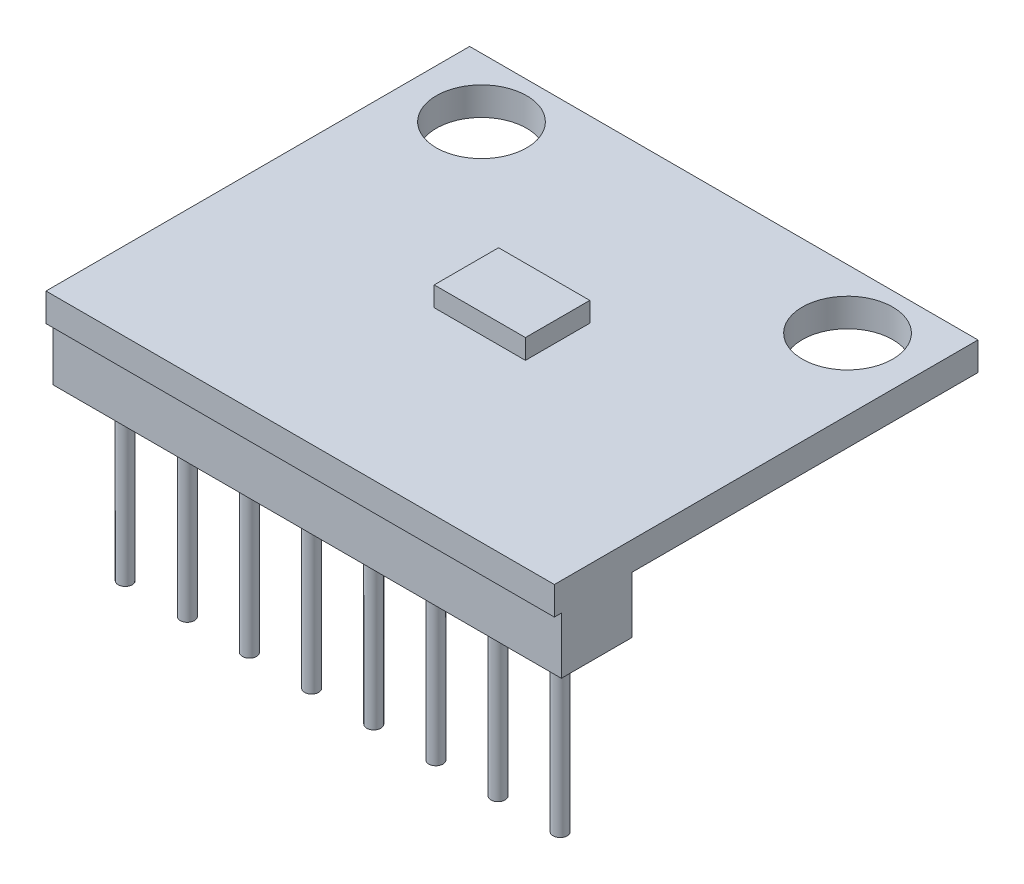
ISO-10303-21;
HEADER;
FILE_DESCRIPTION(('STEP AP214'),'2;1');
FILE_NAME('part.step','',(''),(''),'','','');
FILE_SCHEMA(('AUTOMOTIVE_DESIGN { 1 0 10303 214 1 1 1 1 }'));
ENDSEC;
DATA;
#1=APPLICATION_CONTEXT('core data for automotive mechanical design processes');
#2=APPLICATION_PROTOCOL_DEFINITION('international standard','automotive_design',2000,#1);
#3=PRODUCT_CONTEXT('',#1,'mechanical');
#4=PRODUCT('Part','Part','',(#3));
#5=PRODUCT_RELATED_PRODUCT_CATEGORY('part','',(#4));
#6=PRODUCT_DEFINITION_FORMATION('','',#4);
#7=PRODUCT_DEFINITION_CONTEXT('part definition',#1,'design');
#8=PRODUCT_DEFINITION('design','',#6,#7);
#9=PRODUCT_DEFINITION_SHAPE('','',#8);
#10=(LENGTH_UNIT() NAMED_UNIT(*) SI_UNIT(.MILLI.,.METRE.));
#11=(NAMED_UNIT(*) PLANE_ANGLE_UNIT() SI_UNIT($,.RADIAN.));
#12=(NAMED_UNIT(*) SI_UNIT($,.STERADIAN.) SOLID_ANGLE_UNIT());
#13=UNCERTAINTY_MEASURE_WITH_UNIT(LENGTH_MEASURE(1.E-05),#10,'distance_accuracy_value','');
#14=(GEOMETRIC_REPRESENTATION_CONTEXT(3) GLOBAL_UNCERTAINTY_ASSIGNED_CONTEXT((#13)) GLOBAL_UNIT_ASSIGNED_CONTEXT((#10,
#11,#12)) REPRESENTATION_CONTEXT('',''));
#15=CARTESIAN_POINT('',(0.,0.,0.));
#16=DIRECTION('',(0.,0.,1.));
#17=DIRECTION('',(1.,0.,0.));
#18=AXIS2_PLACEMENT_3D('',#15,#16,#17);
#19=CARTESIAN_POINT('',(0.,-1.,0.));
#20=DIRECTION('',(0.,1.,0.));
#21=DIRECTION('',(0.,0.,1.));
#22=AXIS2_PLACEMENT_3D('',#19,#20,#21);
#23=PLANE('',#22);
#24=CARTESIAN_POINT('',(-6.48,-1.,-5.4));
#25=DIRECTION('',(0.,1.,0.));
#26=DIRECTION('',(0.,0.,1.));
#27=AXIS2_PLACEMENT_3D('',#24,#25,#26);
#28=CIRCLE('',#27,1.6);
#29=CARTESIAN_POINT('',(-6.48,-1.,-3.8));
#30=VERTEX_POINT('',#29);
#31=EDGE_CURVE('E192',#30,#30,#28,.T.);
#32=ORIENTED_EDGE('',*,*,#31,.T.);
#33=EDGE_LOOP('',(#32));
#34=FACE_BOUND('',#33,.T.);
#35=CARTESIAN_POINT('',(6.48,-1.,-5.4));
#36=DIRECTION('',(0.,1.,0.));
#37=DIRECTION('',(0.,0.,-1.));
#38=AXIS2_PLACEMENT_3D('',#35,#36,#37);
#39=CIRCLE('',#38,1.6);
#40=CARTESIAN_POINT('',(6.48,-1.,-7.));
#41=VERTEX_POINT('',#40);
#42=EDGE_CURVE('E186',#41,#41,#39,.T.);
#43=ORIENTED_EDGE('',*,*,#42,.T.);
#44=EDGE_LOOP('',(#43));
#45=FACE_BOUND('',#44,.T.);
#46=DIRECTION('',(1.,0.,0.));
#47=VECTOR('',#46,1.);
#48=CARTESIAN_POINT('',(-9.,-1.,4.75264129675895));
#49=LINE('',#48,#47);
#50=CARTESIAN_POINT('',(-9.,-1.,4.75264129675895));
#51=VERTEX_POINT('',#50);
#52=CARTESIAN_POINT('',(9.00000000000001,-1.,4.75264129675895));
#53=VERTEX_POINT('',#52);
#54=EDGE_CURVE('E54',#51,#53,#49,.T.);
#55=ORIENTED_EDGE('',*,*,#54,.F.);
#56=DIRECTION('',(0.,0.,1.));
#57=VECTOR('',#56,1.);
#58=CARTESIAN_POINT('',(-9.,-1.,-7.5));
#59=LINE('',#58,#57);
#60=CARTESIAN_POINT('',(-9.,-1.,-7.5));
#61=VERTEX_POINT('',#60);
#62=EDGE_CURVE('E203',#61,#51,#59,.T.);
#63=ORIENTED_EDGE('',*,*,#62,.F.);
#64=DIRECTION('',(-1.,0.,0.));
#65=VECTOR('',#64,1.);
#66=CARTESIAN_POINT('',(-9.,-1.,-7.5));
#67=LINE('',#66,#65);
#68=CARTESIAN_POINT('',(9.00000000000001,-1.,-7.5));
#69=VERTEX_POINT('',#68);
#70=EDGE_CURVE('E199',#69,#61,#67,.T.);
#71=ORIENTED_EDGE('',*,*,#70,.F.);
#72=DIRECTION('',(0.,0.,-1.));
#73=VECTOR('',#72,1.);
#74=CARTESIAN_POINT('',(9.00000000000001,-1.,-7.5));
#75=LINE('',#74,#73);
#76=EDGE_CURVE('E59',#53,#69,#75,.T.);
#77=ORIENTED_EDGE('',*,*,#76,.F.);
#78=EDGE_LOOP('',(#55,#63,#71,#77));
#79=FACE_BOUND('',#78,.T.);
#80=ADVANCED_FACE('F37',(#34,#45,#79),#23,.F.);
#81=DIRECTION('',(-1.,0.,0.));
#82=VECTOR('',#81,1.);
#83=CARTESIAN_POINT('',(-9.,-1.,7.25264129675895));
#84=LINE('',#83,#82);
#85=CARTESIAN_POINT('',(9.00000000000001,-1.,7.25264129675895));
#86=VERTEX_POINT('',#85);
#87=CARTESIAN_POINT('',(-9.,-1.,7.25264129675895));
#88=VERTEX_POINT('',#87);
#89=EDGE_CURVE('E235',#86,#88,#84,.T.);
#90=ORIENTED_EDGE('',*,*,#89,.F.);
#91=CARTESIAN_POINT('',(9.00000000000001,-1.,7.5));
#92=VERTEX_POINT('',#91);
#93=EDGE_CURVE('E150',#92,#86,#75,.T.);
#94=ORIENTED_EDGE('',*,*,#93,.F.);
#95=DIRECTION('',(1.,0.,0.));
#96=VECTOR('',#95,1.);
#97=CARTESIAN_POINT('',(-9.,-1.,7.5));
#98=LINE('',#97,#96);
#99=CARTESIAN_POINT('',(-9.,-1.,7.5));
#100=VERTEX_POINT('',#99);
#101=EDGE_CURVE('E205',#100,#92,#98,.T.);
#102=ORIENTED_EDGE('',*,*,#101,.F.);
#103=EDGE_CURVE('E202',#88,#100,#59,.T.);
#104=ORIENTED_EDGE('',*,*,#103,.F.);
#105=EDGE_LOOP('',(#90,#94,#102,#104));
#106=FACE_BOUND('',#105,.T.);
#107=ADVANCED_FACE('F234',(#106),#23,.F.);
#108=CARTESIAN_POINT('',(0.,0.,0.));
#109=DIRECTION('',(0.,1.,0.));
#110=DIRECTION('',(0.,0.,1.));
#111=AXIS2_PLACEMENT_3D('',#108,#109,#110);
#112=PLANE('',#111);
#113=CARTESIAN_POINT('',(6.48,0.,-5.4));
#114=DIRECTION('',(0.,1.,0.));
#115=DIRECTION('',(0.,0.,-1.));
#116=AXIS2_PLACEMENT_3D('',#113,#114,#115);
#117=CIRCLE('',#116,1.6);
#118=CARTESIAN_POINT('',(6.48,0.,-7.));
#119=VERTEX_POINT('',#118);
#120=EDGE_CURVE('E185',#119,#119,#117,.T.);
#121=ORIENTED_EDGE('',*,*,#120,.F.);
#122=EDGE_LOOP('',(#121));
#123=FACE_BOUND('',#122,.T.);
#124=CARTESIAN_POINT('',(-6.48,0.,-5.4));
#125=DIRECTION('',(0.,1.,0.));
#126=DIRECTION('',(0.,0.,1.));
#127=AXIS2_PLACEMENT_3D('',#124,#125,#126);
#128=CIRCLE('',#127,1.6);
#129=CARTESIAN_POINT('',(-6.48,0.,-3.8));
#130=VERTEX_POINT('',#129);
#131=EDGE_CURVE('E189',#130,#130,#128,.T.);
#132=ORIENTED_EDGE('',*,*,#131,.F.);
#133=EDGE_LOOP('',(#132));
#134=FACE_BOUND('',#133,.T.);
#135=DIRECTION('',(0.,0.,-1.));
#136=VECTOR('',#135,1.);
#137=CARTESIAN_POINT('',(9.00000000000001,0.,-7.5));
#138=LINE('',#137,#136);
#139=CARTESIAN_POINT('',(9.00000000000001,0.,7.5));
#140=VERTEX_POINT('',#139);
#141=CARTESIAN_POINT('',(9.00000000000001,0.,-7.5));
#142=VERTEX_POINT('',#141);
#143=EDGE_CURVE('E195',#140,#142,#138,.T.);
#144=ORIENTED_EDGE('',*,*,#143,.T.);
#145=DIRECTION('',(-1.,0.,0.));
#146=VECTOR('',#145,1.);
#147=CARTESIAN_POINT('',(-9.,0.,-7.5));
#148=LINE('',#147,#146);
#149=CARTESIAN_POINT('',(-9.,0.,-7.5));
#150=VERTEX_POINT('',#149);
#151=EDGE_CURVE('E210',#142,#150,#148,.T.);
#152=ORIENTED_EDGE('',*,*,#151,.T.);
#153=DIRECTION('',(0.,0.,1.));
#154=VECTOR('',#153,1.);
#155=CARTESIAN_POINT('',(-9.,0.,-7.5));
#156=LINE('',#155,#154);
#157=CARTESIAN_POINT('',(-9.,0.,7.5));
#158=VERTEX_POINT('',#157);
#159=EDGE_CURVE('E213',#150,#158,#156,.T.);
#160=ORIENTED_EDGE('',*,*,#159,.T.);
#161=DIRECTION('',(1.,0.,0.));
#162=VECTOR('',#161,1.);
#163=CARTESIAN_POINT('',(-9.,0.,7.5));
#164=LINE('',#163,#162);
#165=EDGE_CURVE('E216',#158,#140,#164,.T.);
#166=ORIENTED_EDGE('',*,*,#165,.T.);
#167=EDGE_LOOP('',(#144,#152,#160,#166));
#168=FACE_BOUND('',#167,.T.);
#169=DIRECTION('',(-1.,0.,0.));
#170=VECTOR('',#169,1.);
#171=CARTESIAN_POINT('',(-1.61506043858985,0.,-1.13951486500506));
#172=LINE('',#171,#170);
#173=CARTESIAN_POINT('',(1.61506043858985,0.,-1.13951486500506));
#174=VERTEX_POINT('',#173);
#175=CARTESIAN_POINT('',(-1.61506043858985,0.,-1.13951486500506));
#176=VERTEX_POINT('',#175);
#177=EDGE_CURVE('E154',#174,#176,#172,.T.);
#178=ORIENTED_EDGE('',*,*,#177,.F.);
#179=DIRECTION('',(0.,0.,-1.));
#180=VECTOR('',#179,1.);
#181=CARTESIAN_POINT('',(1.61506043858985,0.,-1.13951486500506));
#182=LINE('',#181,#180);
#183=CARTESIAN_POINT('',(1.61506043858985,0.,1.13951486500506));
#184=VERTEX_POINT('',#183);
#185=EDGE_CURVE('E151',#184,#174,#182,.T.);
#186=ORIENTED_EDGE('',*,*,#185,.F.);
#187=DIRECTION('',(1.,0.,0.));
#188=VECTOR('',#187,1.);
#189=CARTESIAN_POINT('',(-1.61506043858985,0.,1.13951486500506));
#190=LINE('',#189,#188);
#191=CARTESIAN_POINT('',(-1.61506043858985,0.,1.13951486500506));
#192=VERTEX_POINT('',#191);
#193=EDGE_CURVE('E164',#192,#184,#190,.T.);
#194=ORIENTED_EDGE('',*,*,#193,.F.);
#195=DIRECTION('',(0.,0.,1.));
#196=VECTOR('',#195,1.);
#197=CARTESIAN_POINT('',(-1.61506043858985,0.,-1.13951486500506));
#198=LINE('',#197,#196);
#199=EDGE_CURVE('E172',#176,#192,#198,.T.);
#200=ORIENTED_EDGE('',*,*,#199,.F.);
#201=EDGE_LOOP('',(#178,#186,#194,#200));
#202=FACE_BOUND('',#201,.T.);
#203=ADVANCED_FACE('F226',(#123,#134,#168,#202),#112,.T.);
#204=CARTESIAN_POINT('',(9.00000000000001,-1.,-7.5));
#205=DIRECTION('',(1.,0.,0.));
#206=DIRECTION('',(0.,0.,-1.));
#207=AXIS2_PLACEMENT_3D('',#204,#205,#206);
#208=PLANE('',#207);
#209=ORIENTED_EDGE('',*,*,#143,.F.);
#210=DIRECTION('',(0.,1.,0.));
#211=VECTOR('',#210,1.);
#212=CARTESIAN_POINT('',(9.00000000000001,-1.,7.5));
#213=LINE('',#212,#211);
#214=EDGE_CURVE('E11',#92,#140,#213,.T.);
#215=ORIENTED_EDGE('',*,*,#214,.F.);
#216=ORIENTED_EDGE('',*,*,#93,.T.);
#217=DIRECTION('',(0.,1.,0.));
#218=VECTOR('',#217,1.);
#219=CARTESIAN_POINT('',(9.,-3.,7.25264129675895));
#220=LINE('',#219,#218);
#221=CARTESIAN_POINT('',(9.,-3.,7.25264129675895));
#222=VERTEX_POINT('',#221);
#223=EDGE_CURVE('E131',#222,#86,#220,.T.);
#224=ORIENTED_EDGE('',*,*,#223,.F.);
#225=DIRECTION('',(0.,0.,1.));
#226=VECTOR('',#225,1.);
#227=CARTESIAN_POINT('',(9.,-3.,7.25264129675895));
#228=LINE('',#227,#226);
#229=CARTESIAN_POINT('',(9.,-3.,4.75264129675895));
#230=VERTEX_POINT('',#229);
#231=EDGE_CURVE('E137',#230,#222,#228,.T.);
#232=ORIENTED_EDGE('',*,*,#231,.F.);
#233=DIRECTION('',(0.,1.,0.));
#234=VECTOR('',#233,1.);
#235=CARTESIAN_POINT('',(9.,-3.,4.75264129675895));
#236=LINE('',#235,#234);
#237=EDGE_CURVE('E245',#230,#53,#236,.T.);
#238=ORIENTED_EDGE('',*,*,#237,.T.);
#239=ORIENTED_EDGE('',*,*,#76,.T.);
#240=DIRECTION('',(0.,1.,0.));
#241=VECTOR('',#240,1.);
#242=CARTESIAN_POINT('',(9.00000000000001,-1.,-7.5));
#243=LINE('',#242,#241);
#244=EDGE_CURVE('E41',#69,#142,#243,.T.);
#245=ORIENTED_EDGE('',*,*,#244,.T.);
#246=EDGE_LOOP('',(#209,#215,#216,#224,#232,#238,#239,#245));
#247=FACE_BOUND('',#246,.T.);
#248=ADVANCED_FACE('F39',(#247),#208,.T.);
#249=CARTESIAN_POINT('',(-9.,-1.,7.5));
#250=DIRECTION('',(0.,0.,1.));
#251=DIRECTION('',(1.,0.,0.));
#252=AXIS2_PLACEMENT_3D('',#249,#250,#251);
#253=PLANE('',#252);
#254=ORIENTED_EDGE('',*,*,#165,.F.);
#255=DIRECTION('',(0.,1.,0.));
#256=VECTOR('',#255,1.);
#257=CARTESIAN_POINT('',(-9.,-1.,7.5));
#258=LINE('',#257,#256);
#259=EDGE_CURVE('E46',#100,#158,#258,.T.);
#260=ORIENTED_EDGE('',*,*,#259,.F.);
#261=ORIENTED_EDGE('',*,*,#101,.T.);
#262=ORIENTED_EDGE('',*,*,#214,.T.);
#263=EDGE_LOOP('',(#254,#260,#261,#262));
#264=FACE_BOUND('',#263,.T.);
#265=ADVANCED_FACE('F231',(#264),#253,.T.);
#266=CARTESIAN_POINT('',(-9.,-1.,-7.5));
#267=DIRECTION('',(-1.,0.,0.));
#268=DIRECTION('',(0.,0.,1.));
#269=AXIS2_PLACEMENT_3D('',#266,#267,#268);
#270=PLANE('',#269);
#271=ORIENTED_EDGE('',*,*,#159,.F.);
#272=DIRECTION('',(0.,1.,0.));
#273=VECTOR('',#272,1.);
#274=CARTESIAN_POINT('',(-9.,-1.,-7.5));
#275=LINE('',#274,#273);
#276=EDGE_CURVE('E219',#61,#150,#275,.T.);
#277=ORIENTED_EDGE('',*,*,#276,.F.);
#278=ORIENTED_EDGE('',*,*,#62,.T.);
#279=DIRECTION('',(0.,1.,0.));
#280=VECTOR('',#279,1.);
#281=CARTESIAN_POINT('',(-9.,-3.,4.75264129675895));
#282=LINE('',#281,#280);
#283=CARTESIAN_POINT('',(-9.,-3.,4.75264129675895));
#284=VERTEX_POINT('',#283);
#285=EDGE_CURVE('E156',#284,#51,#282,.T.);
#286=ORIENTED_EDGE('',*,*,#285,.F.);
#287=DIRECTION('',(0.,0.,-1.));
#288=VECTOR('',#287,1.);
#289=CARTESIAN_POINT('',(-9.,-3.,7.25264129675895));
#290=LINE('',#289,#288);
#291=CARTESIAN_POINT('',(-9.,-3.,7.25264129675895));
#292=VERTEX_POINT('',#291);
#293=EDGE_CURVE('E136',#292,#284,#290,.T.);
#294=ORIENTED_EDGE('',*,*,#293,.F.);
#295=DIRECTION('',(0.,1.,0.));
#296=VECTOR('',#295,1.);
#297=CARTESIAN_POINT('',(-9.,-3.,7.25264129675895));
#298=LINE('',#297,#296);
#299=EDGE_CURVE('E133',#292,#88,#298,.T.);
#300=ORIENTED_EDGE('',*,*,#299,.T.);
#301=ORIENTED_EDGE('',*,*,#103,.T.);
#302=ORIENTED_EDGE('',*,*,#259,.T.);
#303=EDGE_LOOP('',(#271,#277,#278,#286,#294,#300,#301,#302));
#304=FACE_BOUND('',#303,.T.);
#305=ADVANCED_FACE('F251',(#304),#270,.T.);
#306=CARTESIAN_POINT('',(-9.,-1.,-7.5));
#307=DIRECTION('',(0.,0.,-1.));
#308=DIRECTION('',(-1.,0.,0.));
#309=AXIS2_PLACEMENT_3D('',#306,#307,#308);
#310=PLANE('',#309);
#311=ORIENTED_EDGE('',*,*,#151,.F.);
#312=ORIENTED_EDGE('',*,*,#244,.F.);
#313=ORIENTED_EDGE('',*,*,#70,.T.);
#314=ORIENTED_EDGE('',*,*,#276,.T.);
#315=EDGE_LOOP('',(#311,#312,#313,#314));
#316=FACE_BOUND('',#315,.T.);
#317=ADVANCED_FACE('F224',(#316),#310,.T.);
#318=CARTESIAN_POINT('',(-6.48,-1.,-5.4));
#319=DIRECTION('',(0.,1.,0.));
#320=DIRECTION('',(0.,0.,1.));
#321=AXIS2_PLACEMENT_3D('',#318,#319,#320);
#322=CYLINDRICAL_SURFACE('',#321,1.6);
#323=ORIENTED_EDGE('',*,*,#31,.F.);
#324=EDGE_LOOP('',(#323));
#325=FACE_BOUND('',#324,.T.);
#326=ORIENTED_EDGE('',*,*,#131,.T.);
#327=EDGE_LOOP('',(#326));
#328=FACE_BOUND('',#327,.T.);
#329=ADVANCED_FACE('F261',(#325,#328),#322,.F.);
#330=CARTESIAN_POINT('',(6.48,-1.,-5.4));
#331=DIRECTION('',(0.,1.,0.));
#332=DIRECTION('',(0.,0.,1.));
#333=AXIS2_PLACEMENT_3D('',#330,#331,#332);
#334=CYLINDRICAL_SURFACE('',#333,1.6);
#335=ORIENTED_EDGE('',*,*,#42,.F.);
#336=EDGE_LOOP('',(#335));
#337=FACE_BOUND('',#336,.T.);
#338=ORIENTED_EDGE('',*,*,#120,.T.);
#339=EDGE_LOOP('',(#338));
#340=FACE_BOUND('',#339,.T.);
#341=ADVANCED_FACE('F273',(#337,#340),#334,.F.);
#342=CARTESIAN_POINT('',(1.61506043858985,0.7,-1.13951486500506));
#343=DIRECTION('',(-1.,0.,0.));
#344=DIRECTION('',(0.,0.,1.));
#345=AXIS2_PLACEMENT_3D('',#342,#343,#344);
#346=PLANE('',#345);
#347=ORIENTED_EDGE('',*,*,#185,.T.);
#348=DIRECTION('',(0.,-1.,0.));
#349=VECTOR('',#348,1.);
#350=CARTESIAN_POINT('',(1.61506043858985,0.7,-1.13951486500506));
#351=LINE('',#350,#349);
#352=CARTESIAN_POINT('',(1.61506043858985,0.7,-1.13951486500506));
#353=VERTEX_POINT('',#352);
#354=EDGE_CURVE('E183',#353,#174,#351,.T.);
#355=ORIENTED_EDGE('',*,*,#354,.F.);
#356=DIRECTION('',(0.,0.,-1.));
#357=VECTOR('',#356,1.);
#358=CARTESIAN_POINT('',(1.61506043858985,0.7,-1.13951486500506));
#359=LINE('',#358,#357);
#360=CARTESIAN_POINT('',(1.61506043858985,0.7,1.13951486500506));
#361=VERTEX_POINT('',#360);
#362=EDGE_CURVE('E160',#361,#353,#359,.T.);
#363=ORIENTED_EDGE('',*,*,#362,.F.);
#364=DIRECTION('',(0.,-1.,0.));
#365=VECTOR('',#364,1.);
#366=CARTESIAN_POINT('',(1.61506043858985,0.7,1.13951486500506));
#367=LINE('',#366,#365);
#368=EDGE_CURVE('E169',#361,#184,#367,.T.);
#369=ORIENTED_EDGE('',*,*,#368,.T.);
#370=EDGE_LOOP('',(#347,#355,#363,#369));
#371=FACE_BOUND('',#370,.T.);
#372=ADVANCED_FACE('F278',(#371),#346,.F.);
#373=CARTESIAN_POINT('',(-1.61506043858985,0.7,-1.13951486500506));
#374=DIRECTION('',(0.,0.,1.));
#375=DIRECTION('',(1.,0.,0.));
#376=AXIS2_PLACEMENT_3D('',#373,#374,#375);
#377=PLANE('',#376);
#378=ORIENTED_EDGE('',*,*,#177,.T.);
#379=DIRECTION('',(0.,-1.,0.));
#380=VECTOR('',#379,1.);
#381=CARTESIAN_POINT('',(-1.61506043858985,0.7,-1.13951486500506));
#382=LINE('',#381,#380);
#383=CARTESIAN_POINT('',(-1.61506043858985,0.7,-1.13951486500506));
#384=VERTEX_POINT('',#383);
#385=EDGE_CURVE('E180',#384,#176,#382,.T.);
#386=ORIENTED_EDGE('',*,*,#385,.F.);
#387=DIRECTION('',(-1.,0.,0.));
#388=VECTOR('',#387,1.);
#389=CARTESIAN_POINT('',(-1.61506043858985,0.7,-1.13951486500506));
#390=LINE('',#389,#388);
#391=EDGE_CURVE('E163',#353,#384,#390,.T.);
#392=ORIENTED_EDGE('',*,*,#391,.F.);
#393=ORIENTED_EDGE('',*,*,#354,.T.);
#394=EDGE_LOOP('',(#378,#386,#392,#393));
#395=FACE_BOUND('',#394,.T.);
#396=ADVANCED_FACE('F287',(#395),#377,.F.);
#397=CARTESIAN_POINT('',(-1.61506043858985,0.7,-1.13951486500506));
#398=DIRECTION('',(1.,0.,0.));
#399=DIRECTION('',(0.,0.,-1.));
#400=AXIS2_PLACEMENT_3D('',#397,#398,#399);
#401=PLANE('',#400);
#402=ORIENTED_EDGE('',*,*,#199,.T.);
#403=DIRECTION('',(0.,-1.,0.));
#404=VECTOR('',#403,1.);
#405=CARTESIAN_POINT('',(-1.61506043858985,0.7,1.13951486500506));
#406=LINE('',#405,#404);
#407=CARTESIAN_POINT('',(-1.61506043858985,0.7,1.13951486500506));
#408=VERTEX_POINT('',#407);
#409=EDGE_CURVE('E178',#408,#192,#406,.T.);
#410=ORIENTED_EDGE('',*,*,#409,.F.);
#411=DIRECTION('',(0.,0.,1.));
#412=VECTOR('',#411,1.);
#413=CARTESIAN_POINT('',(-1.61506043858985,0.7,-1.13951486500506));
#414=LINE('',#413,#412);
#415=EDGE_CURVE('E166',#384,#408,#414,.T.);
#416=ORIENTED_EDGE('',*,*,#415,.F.);
#417=ORIENTED_EDGE('',*,*,#385,.T.);
#418=EDGE_LOOP('',(#402,#410,#416,#417));
#419=FACE_BOUND('',#418,.T.);
#420=ADVANCED_FACE('F295',(#419),#401,.F.);
#421=CARTESIAN_POINT('',(-1.61506043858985,0.7,1.13951486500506));
#422=DIRECTION('',(0.,0.,-1.));
#423=DIRECTION('',(-1.,0.,0.));
#424=AXIS2_PLACEMENT_3D('',#421,#422,#423);
#425=PLANE('',#424);
#426=ORIENTED_EDGE('',*,*,#193,.T.);
#427=ORIENTED_EDGE('',*,*,#368,.F.);
#428=DIRECTION('',(1.,0.,0.));
#429=VECTOR('',#428,1.);
#430=CARTESIAN_POINT('',(-1.61506043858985,0.7,1.13951486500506));
#431=LINE('',#430,#429);
#432=EDGE_CURVE('E168',#408,#361,#431,.T.);
#433=ORIENTED_EDGE('',*,*,#432,.F.);
#434=ORIENTED_EDGE('',*,*,#409,.T.);
#435=EDGE_LOOP('',(#426,#427,#433,#434));
#436=FACE_BOUND('',#435,.T.);
#437=ADVANCED_FACE('F299',(#436),#425,.F.);
#438=CARTESIAN_POINT('',(0.,0.7,0.));
#439=DIRECTION('',(0.,1.,0.));
#440=DIRECTION('',(0.,0.,1.));
#441=AXIS2_PLACEMENT_3D('',#438,#439,#440);
#442=PLANE('',#441);
#443=ORIENTED_EDGE('',*,*,#362,.T.);
#444=ORIENTED_EDGE('',*,*,#391,.T.);
#445=ORIENTED_EDGE('',*,*,#415,.T.);
#446=ORIENTED_EDGE('',*,*,#432,.T.);
#447=EDGE_LOOP('',(#443,#444,#445,#446));
#448=FACE_BOUND('',#447,.T.);
#449=ADVANCED_FACE('F303',(#448),#442,.T.);
#450=CARTESIAN_POINT('',(-9.,-3.,7.25264129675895));
#451=DIRECTION('',(0.,0.,-1.));
#452=DIRECTION('',(-1.,0.,0.));
#453=AXIS2_PLACEMENT_3D('',#450,#451,#452);
#454=PLANE('',#453);
#455=ORIENTED_EDGE('',*,*,#89,.T.);
#456=ORIENTED_EDGE('',*,*,#299,.F.);
#457=DIRECTION('',(-1.,0.,0.));
#458=VECTOR('',#457,1.);
#459=CARTESIAN_POINT('',(-9.,-3.,7.25264129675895));
#460=LINE('',#459,#458);
#461=EDGE_CURVE('E126',#222,#292,#460,.T.);
#462=ORIENTED_EDGE('',*,*,#461,.F.);
#463=ORIENTED_EDGE('',*,*,#223,.T.);
#464=EDGE_LOOP('',(#455,#456,#462,#463));
#465=FACE_BOUND('',#464,.T.);
#466=ADVANCED_FACE('F129',(#465),#454,.F.);
#467=CARTESIAN_POINT('',(-9.,-3.,4.75264129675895));
#468=DIRECTION('',(0.,0.,1.));
#469=DIRECTION('',(1.,0.,0.));
#470=AXIS2_PLACEMENT_3D('',#467,#468,#469);
#471=PLANE('',#470);
#472=ORIENTED_EDGE('',*,*,#54,.T.);
#473=ORIENTED_EDGE('',*,*,#237,.F.);
#474=DIRECTION('',(1.,0.,0.));
#475=VECTOR('',#474,1.);
#476=CARTESIAN_POINT('',(-9.,-3.,4.75264129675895));
#477=LINE('',#476,#475);
#478=EDGE_CURVE('E142',#284,#230,#477,.T.);
#479=ORIENTED_EDGE('',*,*,#478,.F.);
#480=ORIENTED_EDGE('',*,*,#285,.T.);
#481=EDGE_LOOP('',(#472,#473,#479,#480));
#482=FACE_BOUND('',#481,.T.);
#483=ADVANCED_FACE('F249',(#482),#471,.F.);
#484=CARTESIAN_POINT('',(0.,-3.,0.));
#485=DIRECTION('',(0.,-1.,0.));
#486=DIRECTION('',(0.,0.,-1.));
#487=AXIS2_PLACEMENT_3D('',#484,#485,#486);
#488=PLANE('',#487);
#489=CARTESIAN_POINT('',(7.68561895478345,-3.,5.98043395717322));
#490=DIRECTION('',(0.,-1.,0.));
#491=DIRECTION('',(0.,0.,-1.));
#492=AXIS2_PLACEMENT_3D('',#489,#490,#491);
#493=CIRCLE('',#492,0.250691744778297);
#494=CARTESIAN_POINT('',(7.68561895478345,-3.,5.72974221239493));
#495=VERTEX_POINT('',#494);
#496=EDGE_CURVE('E386',#495,#495,#493,.T.);
#497=ORIENTED_EDGE('',*,*,#496,.F.);
#498=EDGE_LOOP('',(#497));
#499=FACE_BOUND('',#498,.T.);
#500=CARTESIAN_POINT('',(5.48561895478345,-3.,5.98043395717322));
#501=DIRECTION('',(0.,-1.,0.));
#502=DIRECTION('',(0.,0.,-1.));
#503=AXIS2_PLACEMENT_3D('',#500,#501,#502);
#504=CIRCLE('',#503,0.250691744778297);
#505=CARTESIAN_POINT('',(5.48561895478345,-3.,5.72974221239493));
#506=VERTEX_POINT('',#505);
#507=EDGE_CURVE('E390',#506,#506,#504,.T.);
#508=ORIENTED_EDGE('',*,*,#507,.F.);
#509=EDGE_LOOP('',(#508));
#510=FACE_BOUND('',#509,.T.);
#511=CARTESIAN_POINT('',(3.28561895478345,-3.,5.98043395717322));
#512=DIRECTION('',(0.,-1.,0.));
#513=DIRECTION('',(0.,0.,-1.));
#514=AXIS2_PLACEMENT_3D('',#511,#512,#513);
#515=CIRCLE('',#514,0.250691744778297);
#516=CARTESIAN_POINT('',(3.28561895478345,-3.,5.72974221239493));
#517=VERTEX_POINT('',#516);
#518=EDGE_CURVE('E397',#517,#517,#515,.T.);
#519=ORIENTED_EDGE('',*,*,#518,.F.);
#520=EDGE_LOOP('',(#519));
#521=FACE_BOUND('',#520,.T.);
#522=CARTESIAN_POINT('',(1.08561895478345,-3.,5.98043395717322));
#523=DIRECTION('',(0.,-1.,0.));
#524=DIRECTION('',(0.,0.,-1.));
#525=AXIS2_PLACEMENT_3D('',#522,#523,#524);
#526=CIRCLE('',#525,0.250691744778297);
#527=CARTESIAN_POINT('',(1.08561895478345,-3.,5.72974221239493));
#528=VERTEX_POINT('',#527);
#529=EDGE_CURVE('E403',#528,#528,#526,.T.);
#530=ORIENTED_EDGE('',*,*,#529,.F.);
#531=EDGE_LOOP('',(#530));
#532=FACE_BOUND('',#531,.T.);
#533=CARTESIAN_POINT('',(-1.11438104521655,-3.,5.98043395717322));
#534=DIRECTION('',(0.,-1.,0.));
#535=DIRECTION('',(0.,0.,-1.));
#536=AXIS2_PLACEMENT_3D('',#533,#534,#535);
#537=CIRCLE('',#536,0.250691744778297);
#538=CARTESIAN_POINT('',(-1.11438104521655,-3.,5.72974221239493));
#539=VERTEX_POINT('',#538);
#540=EDGE_CURVE('E409',#539,#539,#537,.T.);
#541=ORIENTED_EDGE('',*,*,#540,.F.);
#542=EDGE_LOOP('',(#541));
#543=FACE_BOUND('',#542,.T.);
#544=CARTESIAN_POINT('',(-3.31438104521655,-3.,5.98043395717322));
#545=DIRECTION('',(0.,-1.,0.));
#546=DIRECTION('',(0.,0.,-1.));
#547=AXIS2_PLACEMENT_3D('',#544,#545,#546);
#548=CIRCLE('',#547,0.250691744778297);
#549=CARTESIAN_POINT('',(-3.31438104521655,-3.,5.72974221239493));
#550=VERTEX_POINT('',#549);
#551=EDGE_CURVE('E415',#550,#550,#548,.T.);
#552=ORIENTED_EDGE('',*,*,#551,.F.);
#553=EDGE_LOOP('',(#552));
#554=FACE_BOUND('',#553,.T.);
#555=CARTESIAN_POINT('',(-5.51438104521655,-3.,5.98043395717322));
#556=DIRECTION('',(0.,-1.,0.));
#557=DIRECTION('',(0.,0.,-1.));
#558=AXIS2_PLACEMENT_3D('',#555,#556,#557);
#559=CIRCLE('',#558,0.250691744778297);
#560=CARTESIAN_POINT('',(-5.51438104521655,-3.,5.72974221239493));
#561=VERTEX_POINT('',#560);
#562=EDGE_CURVE('E421',#561,#561,#559,.T.);
#563=ORIENTED_EDGE('',*,*,#562,.F.);
#564=EDGE_LOOP('',(#563));
#565=FACE_BOUND('',#564,.T.);
#566=CARTESIAN_POINT('',(-7.71438104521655,-3.,5.98043395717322));
#567=DIRECTION('',(0.,-1.,0.));
#568=DIRECTION('',(0.,0.,-1.));
#569=AXIS2_PLACEMENT_3D('',#566,#567,#568);
#570=CIRCLE('',#569,0.250691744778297);
#571=CARTESIAN_POINT('',(-7.71438104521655,-3.,5.72974221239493));
#572=VERTEX_POINT('',#571);
#573=EDGE_CURVE('E240',#572,#572,#570,.T.);
#574=ORIENTED_EDGE('',*,*,#573,.F.);
#575=EDGE_LOOP('',(#574));
#576=FACE_BOUND('',#575,.T.);
#577=ORIENTED_EDGE('',*,*,#231,.T.);
#578=ORIENTED_EDGE('',*,*,#461,.T.);
#579=ORIENTED_EDGE('',*,*,#293,.T.);
#580=ORIENTED_EDGE('',*,*,#478,.T.);
#581=EDGE_LOOP('',(#577,#578,#579,#580));
#582=FACE_BOUND('',#581,.T.);
#583=ADVANCED_FACE('F140',(#499,#510,#521,#532,#543,#554,#565,#576,#582),#488,.T.);
#584=CARTESIAN_POINT('',(-7.71438104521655,-9.,5.98043395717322));
#585=DIRECTION('',(0.,1.,0.));
#586=DIRECTION('',(0.,0.,1.));
#587=AXIS2_PLACEMENT_3D('',#584,#585,#586);
#588=CYLINDRICAL_SURFACE('',#587,0.250691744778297);
#589=CARTESIAN_POINT('',(-7.71438104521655,-9.,5.98043395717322));
#590=DIRECTION('',(0.,-1.,0.));
#591=DIRECTION('',(0.,0.,-1.));
#592=AXIS2_PLACEMENT_3D('',#589,#590,#591);
#593=CIRCLE('',#592,0.250691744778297);
#594=CARTESIAN_POINT('',(-7.71438104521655,-9.,5.72974221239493));
#595=VERTEX_POINT('',#594);
#596=EDGE_CURVE('E236',#595,#595,#593,.T.);
#597=ORIENTED_EDGE('',*,*,#596,.F.);
#598=EDGE_LOOP('',(#597));
#599=FACE_BOUND('',#598,.T.);
#600=ORIENTED_EDGE('',*,*,#573,.T.);
#601=EDGE_LOOP('',(#600));
#602=FACE_BOUND('',#601,.T.);
#603=ADVANCED_FACE('F314',(#599,#602),#588,.T.);
#604=CARTESIAN_POINT('',(-7.71438104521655,-9.,5.98043395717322));
#605=DIRECTION('',(0.,-1.,0.));
#606=DIRECTION('',(0.,0.,-1.));
#607=AXIS2_PLACEMENT_3D('',#604,#605,#606);
#608=PLANE('',#607);
#609=ORIENTED_EDGE('',*,*,#596,.T.);
#610=EDGE_LOOP('',(#609));
#611=FACE_BOUND('',#610,.T.);
#612=ADVANCED_FACE('F318',(#611),#608,.T.);
#613=CARTESIAN_POINT('',(-5.51438104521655,-9.,5.98043395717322));
#614=DIRECTION('',(0.,1.,0.));
#615=DIRECTION('',(0.,0.,1.));
#616=AXIS2_PLACEMENT_3D('',#613,#614,#615);
#617=CYLINDRICAL_SURFACE('',#616,0.250691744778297);
#618=CARTESIAN_POINT('',(-5.51438104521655,-9.,5.98043395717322));
#619=DIRECTION('',(0.,-1.,0.));
#620=DIRECTION('',(0.,0.,-1.));
#621=AXIS2_PLACEMENT_3D('',#618,#619,#620);
#622=CIRCLE('',#621,0.250691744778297);
#623=CARTESIAN_POINT('',(-5.51438104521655,-9.,5.72974221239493));
#624=VERTEX_POINT('',#623);
#625=EDGE_CURVE('E418',#624,#624,#622,.T.);
#626=ORIENTED_EDGE('',*,*,#625,.F.);
#627=EDGE_LOOP('',(#626));
#628=FACE_BOUND('',#627,.T.);
#629=ORIENTED_EDGE('',*,*,#562,.T.);
#630=EDGE_LOOP('',(#629));
#631=FACE_BOUND('',#630,.T.);
#632=ADVANCED_FACE('F322',(#628,#631),#617,.T.);
#633=CARTESIAN_POINT('',(-5.51438104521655,-9.,5.98043395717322));
#634=DIRECTION('',(0.,-1.,0.));
#635=DIRECTION('',(0.,0.,-1.));
#636=AXIS2_PLACEMENT_3D('',#633,#634,#635);
#637=PLANE('',#636);
#638=ORIENTED_EDGE('',*,*,#625,.T.);
#639=EDGE_LOOP('',(#638));
#640=FACE_BOUND('',#639,.T.);
#641=ADVANCED_FACE('F324',(#640),#637,.T.);
#642=CARTESIAN_POINT('',(-3.31438104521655,-9.,5.98043395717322));
#643=DIRECTION('',(0.,1.,0.));
#644=DIRECTION('',(0.,0.,1.));
#645=AXIS2_PLACEMENT_3D('',#642,#643,#644);
#646=CYLINDRICAL_SURFACE('',#645,0.250691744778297);
#647=CARTESIAN_POINT('',(-3.31438104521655,-9.,5.98043395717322));
#648=DIRECTION('',(0.,-1.,0.));
#649=DIRECTION('',(0.,0.,-1.));
#650=AXIS2_PLACEMENT_3D('',#647,#648,#649);
#651=CIRCLE('',#650,0.250691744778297);
#652=CARTESIAN_POINT('',(-3.31438104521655,-9.,5.72974221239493));
#653=VERTEX_POINT('',#652);
#654=EDGE_CURVE('E412',#653,#653,#651,.T.);
#655=ORIENTED_EDGE('',*,*,#654,.F.);
#656=EDGE_LOOP('',(#655));
#657=FACE_BOUND('',#656,.T.);
#658=ORIENTED_EDGE('',*,*,#551,.T.);
#659=EDGE_LOOP('',(#658));
#660=FACE_BOUND('',#659,.T.);
#661=ADVANCED_FACE('F327',(#657,#660),#646,.T.);
#662=CARTESIAN_POINT('',(-3.31438104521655,-9.,5.98043395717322));
#663=DIRECTION('',(0.,-1.,0.));
#664=DIRECTION('',(0.,0.,-1.));
#665=AXIS2_PLACEMENT_3D('',#662,#663,#664);
#666=PLANE('',#665);
#667=ORIENTED_EDGE('',*,*,#654,.T.);
#668=EDGE_LOOP('',(#667));
#669=FACE_BOUND('',#668,.T.);
#670=ADVANCED_FACE('F332',(#669),#666,.T.);
#671=CARTESIAN_POINT('',(-1.11438104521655,-9.,5.98043395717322));
#672=DIRECTION('',(0.,1.,0.));
#673=DIRECTION('',(0.,0.,1.));
#674=AXIS2_PLACEMENT_3D('',#671,#672,#673);
#675=CYLINDRICAL_SURFACE('',#674,0.250691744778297);
#676=CARTESIAN_POINT('',(-1.11438104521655,-9.,5.98043395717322));
#677=DIRECTION('',(0.,-1.,0.));
#678=DIRECTION('',(0.,0.,-1.));
#679=AXIS2_PLACEMENT_3D('',#676,#677,#678);
#680=CIRCLE('',#679,0.250691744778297);
#681=CARTESIAN_POINT('',(-1.11438104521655,-9.,5.72974221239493));
#682=VERTEX_POINT('',#681);
#683=EDGE_CURVE('E406',#682,#682,#680,.T.);
#684=ORIENTED_EDGE('',*,*,#683,.F.);
#685=EDGE_LOOP('',(#684));
#686=FACE_BOUND('',#685,.T.);
#687=ORIENTED_EDGE('',*,*,#540,.T.);
#688=EDGE_LOOP('',(#687));
#689=FACE_BOUND('',#688,.T.);
#690=ADVANCED_FACE('F335',(#686,#689),#675,.T.);
#691=CARTESIAN_POINT('',(-1.11438104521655,-9.,5.98043395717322));
#692=DIRECTION('',(0.,-1.,0.));
#693=DIRECTION('',(0.,0.,-1.));
#694=AXIS2_PLACEMENT_3D('',#691,#692,#693);
#695=PLANE('',#694);
#696=ORIENTED_EDGE('',*,*,#683,.T.);
#697=EDGE_LOOP('',(#696));
#698=FACE_BOUND('',#697,.T.);
#699=ADVANCED_FACE('F340',(#698),#695,.T.);
#700=CARTESIAN_POINT('',(1.08561895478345,-9.,5.98043395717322));
#701=DIRECTION('',(0.,1.,0.));
#702=DIRECTION('',(0.,0.,1.));
#703=AXIS2_PLACEMENT_3D('',#700,#701,#702);
#704=CYLINDRICAL_SURFACE('',#703,0.250691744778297);
#705=CARTESIAN_POINT('',(1.08561895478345,-9.,5.98043395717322));
#706=DIRECTION('',(0.,-1.,0.));
#707=DIRECTION('',(0.,0.,-1.));
#708=AXIS2_PLACEMENT_3D('',#705,#706,#707);
#709=CIRCLE('',#708,0.250691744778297);
#710=CARTESIAN_POINT('',(1.08561895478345,-9.,5.72974221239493));
#711=VERTEX_POINT('',#710);
#712=EDGE_CURVE('E400',#711,#711,#709,.T.);
#713=ORIENTED_EDGE('',*,*,#712,.F.);
#714=EDGE_LOOP('',(#713));
#715=FACE_BOUND('',#714,.T.);
#716=ORIENTED_EDGE('',*,*,#529,.T.);
#717=EDGE_LOOP('',(#716));
#718=FACE_BOUND('',#717,.T.);
#719=ADVANCED_FACE('F343',(#715,#718),#704,.T.);
#720=CARTESIAN_POINT('',(1.08561895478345,-9.,5.98043395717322));
#721=DIRECTION('',(0.,-1.,0.));
#722=DIRECTION('',(0.,0.,-1.));
#723=AXIS2_PLACEMENT_3D('',#720,#721,#722);
#724=PLANE('',#723);
#725=ORIENTED_EDGE('',*,*,#712,.T.);
#726=EDGE_LOOP('',(#725));
#727=FACE_BOUND('',#726,.T.);
#728=ADVANCED_FACE('F348',(#727),#724,.T.);
#729=CARTESIAN_POINT('',(3.28561895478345,-9.,5.98043395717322));
#730=DIRECTION('',(0.,1.,0.));
#731=DIRECTION('',(0.,0.,1.));
#732=AXIS2_PLACEMENT_3D('',#729,#730,#731);
#733=CYLINDRICAL_SURFACE('',#732,0.250691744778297);
#734=CARTESIAN_POINT('',(3.28561895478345,-9.,5.98043395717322));
#735=DIRECTION('',(0.,-1.,0.));
#736=DIRECTION('',(0.,0.,-1.));
#737=AXIS2_PLACEMENT_3D('',#734,#735,#736);
#738=CIRCLE('',#737,0.250691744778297);
#739=CARTESIAN_POINT('',(3.28561895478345,-9.,5.72974221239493));
#740=VERTEX_POINT('',#739);
#741=EDGE_CURVE('E395',#740,#740,#738,.T.);
#742=ORIENTED_EDGE('',*,*,#741,.F.);
#743=EDGE_LOOP('',(#742));
#744=FACE_BOUND('',#743,.T.);
#745=ORIENTED_EDGE('',*,*,#518,.T.);
#746=EDGE_LOOP('',(#745));
#747=FACE_BOUND('',#746,.T.);
#748=ADVANCED_FACE('F351',(#744,#747),#733,.T.);
#749=CARTESIAN_POINT('',(3.28561895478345,-9.,5.98043395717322));
#750=DIRECTION('',(0.,-1.,0.));
#751=DIRECTION('',(0.,0.,-1.));
#752=AXIS2_PLACEMENT_3D('',#749,#750,#751);
#753=PLANE('',#752);
#754=ORIENTED_EDGE('',*,*,#741,.T.);
#755=EDGE_LOOP('',(#754));
#756=FACE_BOUND('',#755,.T.);
#757=ADVANCED_FACE('F356',(#756),#753,.T.);
#758=CARTESIAN_POINT('',(5.48561895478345,-9.,5.98043395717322));
#759=DIRECTION('',(0.,1.,0.));
#760=DIRECTION('',(0.,0.,1.));
#761=AXIS2_PLACEMENT_3D('',#758,#759,#760);
#762=CYLINDRICAL_SURFACE('',#761,0.250691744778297);
#763=CARTESIAN_POINT('',(5.48561895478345,-9.,5.98043395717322));
#764=DIRECTION('',(0.,-1.,0.));
#765=DIRECTION('',(0.,0.,-1.));
#766=AXIS2_PLACEMENT_3D('',#763,#764,#765);
#767=CIRCLE('',#766,0.250691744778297);
#768=CARTESIAN_POINT('',(5.48561895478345,-9.,5.72974221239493));
#769=VERTEX_POINT('',#768);
#770=EDGE_CURVE('E387',#769,#769,#767,.T.);
#771=ORIENTED_EDGE('',*,*,#770,.F.);
#772=EDGE_LOOP('',(#771));
#773=FACE_BOUND('',#772,.T.);
#774=ORIENTED_EDGE('',*,*,#507,.T.);
#775=EDGE_LOOP('',(#774));
#776=FACE_BOUND('',#775,.T.);
#777=ADVANCED_FACE('F359',(#773,#776),#762,.T.);
#778=CARTESIAN_POINT('',(5.48561895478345,-9.,5.98043395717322));
#779=DIRECTION('',(0.,-1.,0.));
#780=DIRECTION('',(0.,0.,-1.));
#781=AXIS2_PLACEMENT_3D('',#778,#779,#780);
#782=PLANE('',#781);
#783=ORIENTED_EDGE('',*,*,#770,.T.);
#784=EDGE_LOOP('',(#783));
#785=FACE_BOUND('',#784,.T.);
#786=ADVANCED_FACE('F364',(#785),#782,.T.);
#787=CARTESIAN_POINT('',(7.68561895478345,-9.,5.98043395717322));
#788=DIRECTION('',(0.,1.,0.));
#789=DIRECTION('',(0.,0.,1.));
#790=AXIS2_PLACEMENT_3D('',#787,#788,#789);
#791=CYLINDRICAL_SURFACE('',#790,0.250691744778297);
#792=CARTESIAN_POINT('',(7.68561895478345,-9.,5.98043395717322));
#793=DIRECTION('',(0.,-1.,0.));
#794=DIRECTION('',(0.,0.,-1.));
#795=AXIS2_PLACEMENT_3D('',#792,#793,#794);
#796=CIRCLE('',#795,0.250691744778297);
#797=CARTESIAN_POINT('',(7.68561895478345,-9.,5.72974221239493));
#798=VERTEX_POINT('',#797);
#799=EDGE_CURVE('E383',#798,#798,#796,.T.);
#800=ORIENTED_EDGE('',*,*,#799,.F.);
#801=EDGE_LOOP('',(#800));
#802=FACE_BOUND('',#801,.T.);
#803=ORIENTED_EDGE('',*,*,#496,.T.);
#804=EDGE_LOOP('',(#803));
#805=FACE_BOUND('',#804,.T.);
#806=ADVANCED_FACE('F367',(#802,#805),#791,.T.);
#807=CARTESIAN_POINT('',(7.68561895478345,-9.,5.98043395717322));
#808=DIRECTION('',(0.,-1.,0.));
#809=DIRECTION('',(0.,0.,-1.));
#810=AXIS2_PLACEMENT_3D('',#807,#808,#809);
#811=PLANE('',#810);
#812=ORIENTED_EDGE('',*,*,#799,.T.);
#813=EDGE_LOOP('',(#812));
#814=FACE_BOUND('',#813,.T.);
#815=ADVANCED_FACE('F372',(#814),#811,.T.);
#816=CLOSED_SHELL('',(#80,#107,#203,#248,#265,#305,#317,#329,#341,#372,#396,#420,#437,#449,#466,
#483,#583,#603,#612,#632,#641,#661,#670,#690,#699,#719,#728,#748,#757,#777,#786,#806,#815));
#817=MANIFOLD_SOLID_BREP('B2',#816);
#818=ADVANCED_BREP_SHAPE_REPRESENTATION('',(#18,#817),#14);
#819=SHAPE_DEFINITION_REPRESENTATION(#9,#818);
ENDSEC;
END-ISO-10303-21;
